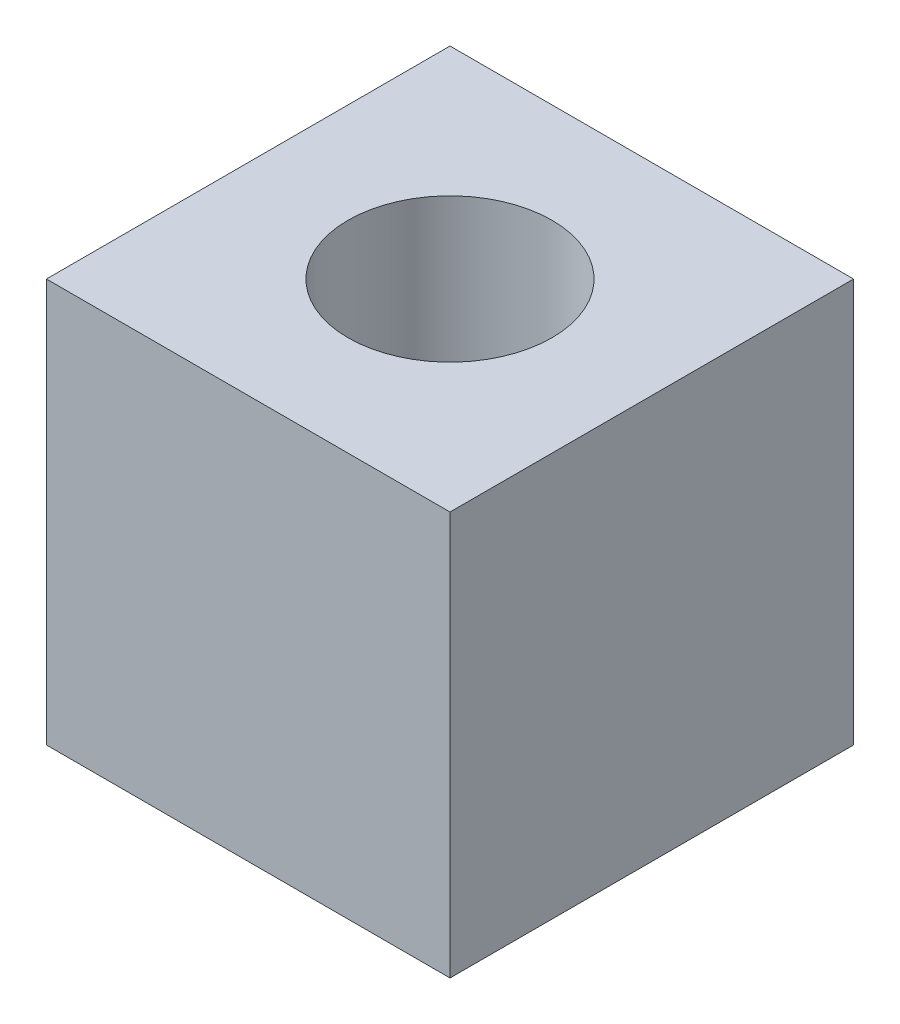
ISO-10303-21;
HEADER;
FILE_DESCRIPTION(('STEP AP214'),'2;1');
FILE_NAME('part.step','',(''),(''),'','','');
FILE_SCHEMA(('AUTOMOTIVE_DESIGN { 1 0 10303 214 1 1 1 1 }'));
ENDSEC;
DATA;
#1=APPLICATION_CONTEXT('core data for automotive mechanical design processes');
#2=APPLICATION_PROTOCOL_DEFINITION('international standard','automotive_design',2000,#1);
#3=PRODUCT_CONTEXT('',#1,'mechanical');
#4=PRODUCT('Part','Part','',(#3));
#5=PRODUCT_RELATED_PRODUCT_CATEGORY('part','',(#4));
#6=PRODUCT_DEFINITION_FORMATION('','',#4);
#7=PRODUCT_DEFINITION_CONTEXT('part definition',#1,'design');
#8=PRODUCT_DEFINITION('design','',#6,#7);
#9=PRODUCT_DEFINITION_SHAPE('','',#8);
#10=(LENGTH_UNIT() NAMED_UNIT(*) SI_UNIT(.MILLI.,.METRE.));
#11=(NAMED_UNIT(*) PLANE_ANGLE_UNIT() SI_UNIT($,.RADIAN.));
#12=(NAMED_UNIT(*) SI_UNIT($,.STERADIAN.) SOLID_ANGLE_UNIT());
#13=UNCERTAINTY_MEASURE_WITH_UNIT(LENGTH_MEASURE(1.E-05),#10,'distance_accuracy_value','');
#14=(GEOMETRIC_REPRESENTATION_CONTEXT(3) GLOBAL_UNCERTAINTY_ASSIGNED_CONTEXT((#13)) GLOBAL_UNIT_ASSIGNED_CONTEXT((#10,
#11,#12)) REPRESENTATION_CONTEXT('',''));
#15=CARTESIAN_POINT('',(0.,0.,0.));
#16=DIRECTION('',(0.,0.,1.));
#17=DIRECTION('',(1.,0.,0.));
#18=AXIS2_PLACEMENT_3D('',#15,#16,#17);
#19=CARTESIAN_POINT('',(0.,50.8,0.));
#20=DIRECTION('',(0.,-1.,0.));
#21=DIRECTION('',(0.,0.,-1.));
#22=AXIS2_PLACEMENT_3D('',#19,#20,#21);
#23=PLANE('',#22);
#24=DIRECTION('',(0.,0.,-1.));
#25=VECTOR('',#24,1.);
#26=CARTESIAN_POINT('',(25.4,50.8,25.4));
#27=LINE('',#26,#25);
#28=CARTESIAN_POINT('',(25.4,50.8,25.4));
#29=VERTEX_POINT('',#28);
#30=CARTESIAN_POINT('',(25.4,50.8,-25.4));
#31=VERTEX_POINT('',#30);
#32=EDGE_CURVE('E98',#29,#31,#27,.T.);
#33=ORIENTED_EDGE('',*,*,#32,.T.);
#34=DIRECTION('',(-1.,0.,0.));
#35=VECTOR('',#34,1.);
#36=CARTESIAN_POINT('',(-25.4,50.8,-25.4));
#37=LINE('',#36,#35);
#38=CARTESIAN_POINT('',(-25.4,50.8,-25.4));
#39=VERTEX_POINT('',#38);
#40=EDGE_CURVE('E93',#31,#39,#37,.T.);
#41=ORIENTED_EDGE('',*,*,#40,.T.);
#42=DIRECTION('',(0.,0.,1.));
#43=VECTOR('',#42,1.);
#44=CARTESIAN_POINT('',(-25.4,50.8,25.4));
#45=LINE('',#44,#43);
#46=CARTESIAN_POINT('',(-25.4,50.8,25.4));
#47=VERTEX_POINT('',#46);
#48=EDGE_CURVE('E96',#39,#47,#45,.T.);
#49=ORIENTED_EDGE('',*,*,#48,.T.);
#50=DIRECTION('',(1.,0.,0.));
#51=VECTOR('',#50,1.);
#52=CARTESIAN_POINT('',(-25.4,50.8,25.4));
#53=LINE('',#52,#51);
#54=EDGE_CURVE('E63',#47,#29,#53,.T.);
#55=ORIENTED_EDGE('',*,*,#54,.T.);
#56=EDGE_LOOP('',(#33,#41,#49,#55));
#57=FACE_BOUND('',#56,.T.);
#58=CARTESIAN_POINT('',(0.,50.8,0.));
#59=DIRECTION('',(0.,1.,0.));
#60=DIRECTION('',(0.,0.,1.));
#61=AXIS2_PLACEMENT_3D('',#58,#59,#60);
#62=CIRCLE('',#61,12.827);
#63=CARTESIAN_POINT('',(0.,50.8,12.827));
#64=VERTEX_POINT('',#63);
#65=EDGE_CURVE('E118',#64,#64,#62,.T.);
#66=ORIENTED_EDGE('',*,*,#65,.F.);
#67=EDGE_LOOP('',(#66));
#68=FACE_BOUND('',#67,.T.);
#69=ADVANCED_FACE('F45',(#57,#68),#23,.F.);
#70=CARTESIAN_POINT('',(0.,0.,0.));
#71=DIRECTION('',(0.,-1.,0.));
#72=DIRECTION('',(0.,0.,-1.));
#73=AXIS2_PLACEMENT_3D('',#70,#71,#72);
#74=PLANE('',#73);
#75=DIRECTION('',(0.,0.,-1.));
#76=VECTOR('',#75,1.);
#77=CARTESIAN_POINT('',(25.4,0.,25.4));
#78=LINE('',#77,#76);
#79=CARTESIAN_POINT('',(25.4,0.,25.4));
#80=VERTEX_POINT('',#79);
#81=CARTESIAN_POINT('',(25.4,0.,-25.4));
#82=VERTEX_POINT('',#81);
#83=EDGE_CURVE('E114',#80,#82,#78,.T.);
#84=ORIENTED_EDGE('',*,*,#83,.F.);
#85=DIRECTION('',(1.,0.,0.));
#86=VECTOR('',#85,1.);
#87=CARTESIAN_POINT('',(-25.4,0.,25.4));
#88=LINE('',#87,#86);
#89=CARTESIAN_POINT('',(-25.4,0.,25.4));
#90=VERTEX_POINT('',#89);
#91=EDGE_CURVE('E86',#90,#80,#88,.T.);
#92=ORIENTED_EDGE('',*,*,#91,.F.);
#93=DIRECTION('',(0.,0.,1.));
#94=VECTOR('',#93,1.);
#95=CARTESIAN_POINT('',(-25.4,0.,25.4));
#96=LINE('',#95,#94);
#97=CARTESIAN_POINT('',(-25.4,0.,-25.4));
#98=VERTEX_POINT('',#97);
#99=EDGE_CURVE('E80',#98,#90,#96,.T.);
#100=ORIENTED_EDGE('',*,*,#99,.F.);
#101=DIRECTION('',(-1.,0.,0.));
#102=VECTOR('',#101,1.);
#103=CARTESIAN_POINT('',(-25.4,0.,-25.4));
#104=LINE('',#103,#102);
#105=EDGE_CURVE('E103',#82,#98,#104,.T.);
#106=ORIENTED_EDGE('',*,*,#105,.F.);
#107=EDGE_LOOP('',(#84,#92,#100,#106));
#108=FACE_BOUND('',#107,.T.);
#109=CARTESIAN_POINT('',(0.,0.,0.));
#110=DIRECTION('',(0.,1.,0.));
#111=DIRECTION('',(0.,0.,1.));
#112=AXIS2_PLACEMENT_3D('',#109,#110,#111);
#113=CIRCLE('',#112,12.827);
#114=CARTESIAN_POINT('',(0.,0.,12.827));
#115=VERTEX_POINT('',#114);
#116=EDGE_CURVE('E136',#115,#115,#113,.T.);
#117=ORIENTED_EDGE('',*,*,#116,.T.);
#118=EDGE_LOOP('',(#117));
#119=FACE_BOUND('',#118,.T.);
#120=ADVANCED_FACE('F131',(#108,#119),#74,.T.);
#121=CARTESIAN_POINT('',(25.4,50.8,25.4));
#122=DIRECTION('',(-1.,0.,0.));
#123=DIRECTION('',(0.,0.,1.));
#124=AXIS2_PLACEMENT_3D('',#121,#122,#123);
#125=PLANE('',#124);
#126=ORIENTED_EDGE('',*,*,#83,.T.);
#127=DIRECTION('',(0.,-1.,0.));
#128=VECTOR('',#127,1.);
#129=CARTESIAN_POINT('',(25.4,50.8,-25.4));
#130=LINE('',#129,#128);
#131=EDGE_CURVE('E11',#31,#82,#130,.T.);
#132=ORIENTED_EDGE('',*,*,#131,.F.);
#133=ORIENTED_EDGE('',*,*,#32,.F.);
#134=DIRECTION('',(0.,-1.,0.));
#135=VECTOR('',#134,1.);
#136=CARTESIAN_POINT('',(25.4,50.8,25.4));
#137=LINE('',#136,#135);
#138=EDGE_CURVE('E110',#29,#80,#137,.T.);
#139=ORIENTED_EDGE('',*,*,#138,.T.);
#140=EDGE_LOOP('',(#126,#132,#133,#139));
#141=FACE_BOUND('',#140,.T.);
#142=ADVANCED_FACE('F47',(#141),#125,.F.);
#143=CARTESIAN_POINT('',(-25.4,50.8,-25.4));
#144=DIRECTION('',(0.,0.,1.));
#145=DIRECTION('',(1.,0.,0.));
#146=AXIS2_PLACEMENT_3D('',#143,#144,#145);
#147=PLANE('',#146);
#148=ORIENTED_EDGE('',*,*,#105,.T.);
#149=DIRECTION('',(0.,-1.,0.));
#150=VECTOR('',#149,1.);
#151=CARTESIAN_POINT('',(-25.4,50.8,-25.4));
#152=LINE('',#151,#150);
#153=EDGE_CURVE('E55',#39,#98,#152,.T.);
#154=ORIENTED_EDGE('',*,*,#153,.F.);
#155=ORIENTED_EDGE('',*,*,#40,.F.);
#156=ORIENTED_EDGE('',*,*,#131,.T.);
#157=EDGE_LOOP('',(#148,#154,#155,#156));
#158=FACE_BOUND('',#157,.T.);
#159=ADVANCED_FACE('F102',(#158),#147,.F.);
#160=CARTESIAN_POINT('',(-25.4,50.8,25.4));
#161=DIRECTION('',(1.,0.,0.));
#162=DIRECTION('',(0.,0.,-1.));
#163=AXIS2_PLACEMENT_3D('',#160,#161,#162);
#164=PLANE('',#163);
#165=ORIENTED_EDGE('',*,*,#99,.T.);
#166=DIRECTION('',(0.,-1.,0.));
#167=VECTOR('',#166,1.);
#168=CARTESIAN_POINT('',(-25.4,50.8,25.4));
#169=LINE('',#168,#167);
#170=EDGE_CURVE('E105',#47,#90,#169,.T.);
#171=ORIENTED_EDGE('',*,*,#170,.F.);
#172=ORIENTED_EDGE('',*,*,#48,.F.);
#173=ORIENTED_EDGE('',*,*,#153,.T.);
#174=EDGE_LOOP('',(#165,#171,#172,#173));
#175=FACE_BOUND('',#174,.T.);
#176=ADVANCED_FACE('F106',(#175),#164,.F.);
#177=CARTESIAN_POINT('',(-25.4,50.8,25.4));
#178=DIRECTION('',(0.,0.,-1.));
#179=DIRECTION('',(-1.,0.,0.));
#180=AXIS2_PLACEMENT_3D('',#177,#178,#179);
#181=PLANE('',#180);
#182=ORIENTED_EDGE('',*,*,#91,.T.);
#183=ORIENTED_EDGE('',*,*,#138,.F.);
#184=ORIENTED_EDGE('',*,*,#54,.F.);
#185=ORIENTED_EDGE('',*,*,#170,.T.);
#186=EDGE_LOOP('',(#182,#183,#184,#185));
#187=FACE_BOUND('',#186,.T.);
#188=ADVANCED_FACE('F128',(#187),#181,.F.);
#189=CARTESIAN_POINT('',(0.,50.8,0.));
#190=DIRECTION('',(0.,-1.,0.));
#191=DIRECTION('',(0.,0.,-1.));
#192=AXIS2_PLACEMENT_3D('',#189,#190,#191);
#193=CYLINDRICAL_SURFACE('',#192,12.827);
#194=ORIENTED_EDGE('',*,*,#65,.T.);
#195=EDGE_LOOP('',(#194));
#196=FACE_BOUND('',#195,.T.);
#197=ORIENTED_EDGE('',*,*,#116,.F.);
#198=EDGE_LOOP('',(#197));
#199=FACE_BOUND('',#198,.T.);
#200=ADVANCED_FACE('F144',(#196,#199),#193,.F.);
#201=CLOSED_SHELL('',(#69,#120,#142,#159,#176,#188,#200));
#202=MANIFOLD_SOLID_BREP('B2',#201);
#203=ADVANCED_BREP_SHAPE_REPRESENTATION('',(#18,#202),#14);
#204=SHAPE_DEFINITION_REPRESENTATION(#9,#203);
ENDSEC;
END-ISO-10303-21;
